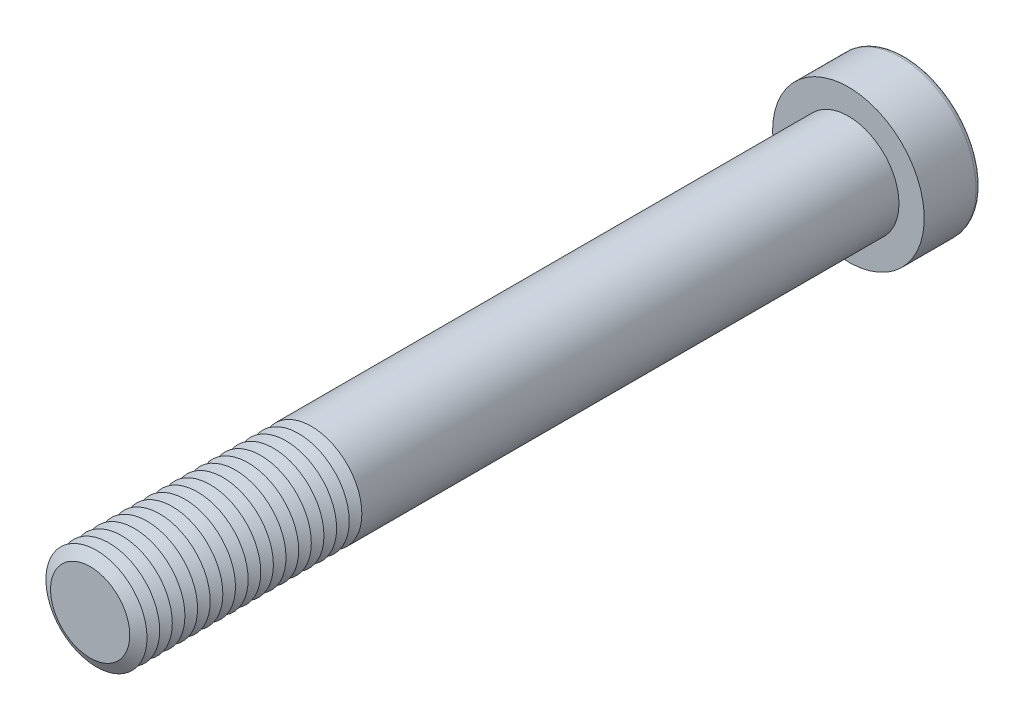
ISO-10303-21;
HEADER;
FILE_DESCRIPTION(('STEP AP214'),'2;1');
FILE_NAME('part.step','',(''),(''),'','','');
FILE_SCHEMA(('AUTOMOTIVE_DESIGN { 1 0 10303 214 1 1 1 1 }'));
ENDSEC;
DATA;
#1=APPLICATION_CONTEXT('core data for automotive mechanical design processes');
#2=APPLICATION_PROTOCOL_DEFINITION('international standard','automotive_design',2000,#1);
#3=PRODUCT_CONTEXT('',#1,'mechanical');
#4=PRODUCT('Part','Part','',(#3));
#5=PRODUCT_RELATED_PRODUCT_CATEGORY('part','',(#4));
#6=PRODUCT_DEFINITION_FORMATION('','',#4);
#7=PRODUCT_DEFINITION_CONTEXT('part definition',#1,'design');
#8=PRODUCT_DEFINITION('design','',#6,#7);
#9=PRODUCT_DEFINITION_SHAPE('','',#8);
#10=(LENGTH_UNIT() NAMED_UNIT(*) SI_UNIT(.MILLI.,.METRE.));
#11=(NAMED_UNIT(*) PLANE_ANGLE_UNIT() SI_UNIT($,.RADIAN.));
#12=(NAMED_UNIT(*) SI_UNIT($,.STERADIAN.) SOLID_ANGLE_UNIT());
#13=UNCERTAINTY_MEASURE_WITH_UNIT(LENGTH_MEASURE(1.E-05),#10,'distance_accuracy_value','');
#14=(GEOMETRIC_REPRESENTATION_CONTEXT(3) GLOBAL_UNCERTAINTY_ASSIGNED_CONTEXT((#13)) GLOBAL_UNIT_ASSIGNED_CONTEXT((#10,
#11,#12)) REPRESENTATION_CONTEXT('',''));
#15=CARTESIAN_POINT('',(0.,0.,0.));
#16=DIRECTION('',(0.,0.,1.));
#17=DIRECTION('',(1.,0.,0.));
#18=AXIS2_PLACEMENT_3D('',#15,#16,#17);
#19=CARTESIAN_POINT('',(0.,0.,113.));
#20=DIRECTION('',(0.,0.,1.));
#21=DIRECTION('',(1.,0.,0.));
#22=AXIS2_PLACEMENT_3D('',#19,#20,#21);
#23=CONICAL_SURFACE('',#22,8.,1.0471975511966);
#24=CARTESIAN_POINT('',(0.,0.,112.));
#25=DIRECTION('',(0.,0.,1.));
#26=DIRECTION('',(1.,0.,0.));
#27=AXIS2_PLACEMENT_3D('',#24,#25,#26);
#28=CIRCLE('',#27,6.26794919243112);
#29=CARTESIAN_POINT('',(6.26794919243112,0.,112.));
#30=VERTEX_POINT('',#29);
#31=EDGE_CURVE('E313',#30,#30,#28,.T.);
#32=ORIENTED_EDGE('',*,*,#31,.T.);
#33=EDGE_LOOP('',(#32));
#34=FACE_BOUND('',#33,.T.);
#35=CARTESIAN_POINT('',(0.,0.,113.));
#36=DIRECTION('',(0.,0.,1.));
#37=DIRECTION('',(1.,0.,0.));
#38=AXIS2_PLACEMENT_3D('',#35,#36,#37);
#39=CIRCLE('',#38,8.);
#40=CARTESIAN_POINT('',(8.,0.,113.));
#41=VERTEX_POINT('',#40);
#42=EDGE_CURVE('E316',#41,#41,#39,.T.);
#43=ORIENTED_EDGE('',*,*,#42,.F.);
#44=EDGE_LOOP('',(#43));
#45=FACE_BOUND('',#44,.T.);
#46=ADVANCED_FACE('F39',(#34,#45),#23,.T.);
#47=CARTESIAN_POINT('',(0.,0.,112.));
#48=DIRECTION('',(0.,0.,-1.));
#49=DIRECTION('',(-1.,0.,0.));
#50=AXIS2_PLACEMENT_3D('',#47,#48,#49);
#51=CONICAL_SURFACE('',#50,6.26794919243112,1.0471975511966);
#52=CARTESIAN_POINT('',(0.,0.,111.));
#53=DIRECTION('',(0.,0.,1.));
#54=DIRECTION('',(1.,0.,0.));
#55=AXIS2_PLACEMENT_3D('',#52,#53,#54);
#56=CIRCLE('',#55,8.);
#57=CARTESIAN_POINT('',(8.,0.,111.));
#58=VERTEX_POINT('',#57);
#59=EDGE_CURVE('E324',#58,#58,#56,.T.);
#60=ORIENTED_EDGE('',*,*,#59,.T.);
#61=EDGE_LOOP('',(#60));
#62=FACE_BOUND('',#61,.T.);
#63=ORIENTED_EDGE('',*,*,#31,.F.);
#64=EDGE_LOOP('',(#63));
#65=FACE_BOUND('',#64,.T.);
#66=ADVANCED_FACE('F244',(#62,#65),#51,.T.);
#67=CARTESIAN_POINT('',(0.,0.,120.));
#68=DIRECTION('',(0.,0.,1.));
#69=DIRECTION('',(1.,0.,0.));
#70=AXIS2_PLACEMENT_3D('',#67,#68,#69);
#71=PLANE('',#70);
#72=CARTESIAN_POINT('',(0.,0.,120.));
#73=DIRECTION('',(0.,0.,1.));
#74=DIRECTION('',(1.,0.,0.));
#75=AXIS2_PLACEMENT_3D('',#72,#73,#74);
#76=CIRCLE('',#75,6.26794919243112);
#77=CARTESIAN_POINT('',(6.26794919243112,0.,120.));
#78=VERTEX_POINT('',#77);
#79=EDGE_CURVE('E174',#78,#78,#76,.T.);
#80=ORIENTED_EDGE('',*,*,#79,.T.);
#81=EDGE_LOOP('',(#80));
#82=FACE_BOUND('',#81,.T.);
#83=ADVANCED_FACE('F250',(#82),#71,.T.);
#84=CARTESIAN_POINT('',(0.,0.,120.));
#85=DIRECTION('',(0.,0.,-1.));
#86=DIRECTION('',(-1.,0.,0.));
#87=AXIS2_PLACEMENT_3D('',#84,#85,#86);
#88=CONICAL_SURFACE('',#87,6.26794919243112,1.0471975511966);
#89=CARTESIAN_POINT('',(0.,0.,119.));
#90=DIRECTION('',(0.,0.,1.));
#91=DIRECTION('',(1.,0.,0.));
#92=AXIS2_PLACEMENT_3D('',#89,#90,#91);
#93=CIRCLE('',#92,8.);
#94=CARTESIAN_POINT('',(8.,0.,119.));
#95=VERTEX_POINT('',#94);
#96=EDGE_CURVE('E290',#95,#95,#93,.T.);
#97=ORIENTED_EDGE('',*,*,#96,.T.);
#98=EDGE_LOOP('',(#97));
#99=FACE_BOUND('',#98,.T.);
#100=ORIENTED_EDGE('',*,*,#79,.F.);
#101=EDGE_LOOP('',(#100));
#102=FACE_BOUND('',#101,.T.);
#103=ADVANCED_FACE('F198',(#99,#102),#88,.T.);
#104=CARTESIAN_POINT('',(0.,0.,119.));
#105=DIRECTION('',(0.,0.,1.));
#106=DIRECTION('',(1.,0.,0.));
#107=AXIS2_PLACEMENT_3D('',#104,#105,#106);
#108=CONICAL_SURFACE('',#107,8.,1.0471975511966);
#109=CARTESIAN_POINT('',(0.,0.,118.));
#110=DIRECTION('',(0.,0.,1.));
#111=DIRECTION('',(1.,0.,0.));
#112=AXIS2_PLACEMENT_3D('',#109,#110,#111);
#113=CIRCLE('',#112,6.26794919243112);
#114=CARTESIAN_POINT('',(6.26794919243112,0.,118.));
#115=VERTEX_POINT('',#114);
#116=EDGE_CURVE('E287',#115,#115,#113,.T.);
#117=ORIENTED_EDGE('',*,*,#116,.T.);
#118=EDGE_LOOP('',(#117));
#119=FACE_BOUND('',#118,.T.);
#120=ORIENTED_EDGE('',*,*,#96,.F.);
#121=EDGE_LOOP('',(#120));
#122=FACE_BOUND('',#121,.T.);
#123=ADVANCED_FACE('F276',(#119,#122),#108,.T.);
#124=CARTESIAN_POINT('',(0.,0.,118.));
#125=DIRECTION('',(0.,0.,-1.));
#126=DIRECTION('',(-1.,0.,0.));
#127=AXIS2_PLACEMENT_3D('',#124,#125,#126);
#128=CONICAL_SURFACE('',#127,6.26794919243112,1.0471975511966);
#129=CARTESIAN_POINT('',(0.,0.,117.));
#130=DIRECTION('',(0.,0.,1.));
#131=DIRECTION('',(1.,0.,0.));
#132=AXIS2_PLACEMENT_3D('',#129,#130,#131);
#133=CIRCLE('',#132,8.);
#134=CARTESIAN_POINT('',(8.,0.,117.));
#135=VERTEX_POINT('',#134);
#136=EDGE_CURVE('E299',#135,#135,#133,.T.);
#137=ORIENTED_EDGE('',*,*,#136,.T.);
#138=EDGE_LOOP('',(#137));
#139=FACE_BOUND('',#138,.T.);
#140=ORIENTED_EDGE('',*,*,#116,.F.);
#141=EDGE_LOOP('',(#140));
#142=FACE_BOUND('',#141,.T.);
#143=ADVANCED_FACE('F273',(#139,#142),#128,.T.);
#144=CARTESIAN_POINT('',(0.,0.,117.));
#145=DIRECTION('',(0.,0.,1.));
#146=DIRECTION('',(1.,0.,0.));
#147=AXIS2_PLACEMENT_3D('',#144,#145,#146);
#148=CONICAL_SURFACE('',#147,8.,1.0471975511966);
#149=CARTESIAN_POINT('',(0.,0.,116.));
#150=DIRECTION('',(0.,0.,1.));
#151=DIRECTION('',(1.,0.,0.));
#152=AXIS2_PLACEMENT_3D('',#149,#150,#151);
#153=CIRCLE('',#152,6.26794919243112);
#154=CARTESIAN_POINT('',(6.26794919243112,0.,116.));
#155=VERTEX_POINT('',#154);
#156=EDGE_CURVE('E292',#155,#155,#153,.T.);
#157=ORIENTED_EDGE('',*,*,#156,.T.);
#158=EDGE_LOOP('',(#157));
#159=FACE_BOUND('',#158,.T.);
#160=ORIENTED_EDGE('',*,*,#136,.F.);
#161=EDGE_LOOP('',(#160));
#162=FACE_BOUND('',#161,.T.);
#163=ADVANCED_FACE('F269',(#159,#162),#148,.T.);
#164=CARTESIAN_POINT('',(0.,0.,116.));
#165=DIRECTION('',(0.,0.,-1.));
#166=DIRECTION('',(-1.,0.,0.));
#167=AXIS2_PLACEMENT_3D('',#164,#165,#166);
#168=CONICAL_SURFACE('',#167,6.26794919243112,1.0471975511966);
#169=CARTESIAN_POINT('',(0.,0.,115.));
#170=DIRECTION('',(0.,0.,1.));
#171=DIRECTION('',(1.,0.,0.));
#172=AXIS2_PLACEMENT_3D('',#169,#170,#171);
#173=CIRCLE('',#172,8.);
#174=CARTESIAN_POINT('',(8.,0.,115.));
#175=VERTEX_POINT('',#174);
#176=EDGE_CURVE('E309',#175,#175,#173,.T.);
#177=ORIENTED_EDGE('',*,*,#176,.T.);
#178=EDGE_LOOP('',(#177));
#179=FACE_BOUND('',#178,.T.);
#180=ORIENTED_EDGE('',*,*,#156,.F.);
#181=EDGE_LOOP('',(#180));
#182=FACE_BOUND('',#181,.T.);
#183=ADVANCED_FACE('F265',(#179,#182),#168,.T.);
#184=CARTESIAN_POINT('',(0.,0.,115.));
#185=DIRECTION('',(0.,0.,1.));
#186=DIRECTION('',(1.,0.,0.));
#187=AXIS2_PLACEMENT_3D('',#184,#185,#186);
#188=CONICAL_SURFACE('',#187,8.,1.0471975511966);
#189=CARTESIAN_POINT('',(0.,0.,114.));
#190=DIRECTION('',(0.,0.,1.));
#191=DIRECTION('',(1.,0.,0.));
#192=AXIS2_PLACEMENT_3D('',#189,#190,#191);
#193=CIRCLE('',#192,6.26794919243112);
#194=CARTESIAN_POINT('',(6.26794919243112,0.,114.));
#195=VERTEX_POINT('',#194);
#196=EDGE_CURVE('E305',#195,#195,#193,.T.);
#197=ORIENTED_EDGE('',*,*,#196,.T.);
#198=EDGE_LOOP('',(#197));
#199=FACE_BOUND('',#198,.T.);
#200=ORIENTED_EDGE('',*,*,#176,.F.);
#201=EDGE_LOOP('',(#200));
#202=FACE_BOUND('',#201,.T.);
#203=ADVANCED_FACE('F261',(#199,#202),#188,.T.);
#204=CARTESIAN_POINT('',(0.,0.,114.));
#205=DIRECTION('',(0.,0.,-1.));
#206=DIRECTION('',(-1.,0.,0.));
#207=AXIS2_PLACEMENT_3D('',#204,#205,#206);
#208=CONICAL_SURFACE('',#207,6.26794919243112,1.0471975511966);
#209=ORIENTED_EDGE('',*,*,#42,.T.);
#210=EDGE_LOOP('',(#209));
#211=FACE_BOUND('',#210,.T.);
#212=ORIENTED_EDGE('',*,*,#196,.F.);
#213=EDGE_LOOP('',(#212));
#214=FACE_BOUND('',#213,.T.);
#215=ADVANCED_FACE('F257',(#211,#214),#208,.T.);
#216=CARTESIAN_POINT('',(0.,0.,111.));
#217=DIRECTION('',(0.,0.,1.));
#218=DIRECTION('',(1.,0.,0.));
#219=AXIS2_PLACEMENT_3D('',#216,#217,#218);
#220=CONICAL_SURFACE('',#219,8.,1.0471975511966);
#221=CARTESIAN_POINT('',(0.,0.,110.));
#222=DIRECTION('',(0.,0.,1.));
#223=DIRECTION('',(1.,0.,0.));
#224=AXIS2_PLACEMENT_3D('',#221,#222,#223);
#225=CIRCLE('',#224,6.26794919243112);
#226=CARTESIAN_POINT('',(6.26794919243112,0.,110.));
#227=VERTEX_POINT('',#226);
#228=EDGE_CURVE('E320',#227,#227,#225,.T.);
#229=ORIENTED_EDGE('',*,*,#228,.T.);
#230=EDGE_LOOP('',(#229));
#231=FACE_BOUND('',#230,.T.);
#232=ORIENTED_EDGE('',*,*,#59,.F.);
#233=EDGE_LOOP('',(#232));
#234=FACE_BOUND('',#233,.T.);
#235=ADVANCED_FACE('F260',(#231,#234),#220,.T.);
#236=CARTESIAN_POINT('',(0.,0.,110.));
#237=DIRECTION('',(0.,0.,-1.));
#238=DIRECTION('',(-1.,0.,0.));
#239=AXIS2_PLACEMENT_3D('',#236,#237,#238);
#240=CONICAL_SURFACE('',#239,6.26794919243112,1.0471975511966);
#241=CARTESIAN_POINT('',(0.,0.,109.));
#242=DIRECTION('',(0.,0.,1.));
#243=DIRECTION('',(1.,0.,0.));
#244=AXIS2_PLACEMENT_3D('',#241,#242,#243);
#245=CIRCLE('',#244,8.);
#246=CARTESIAN_POINT('',(8.,0.,109.));
#247=VERTEX_POINT('',#246);
#248=EDGE_CURVE('E332',#247,#247,#245,.T.);
#249=ORIENTED_EDGE('',*,*,#248,.T.);
#250=EDGE_LOOP('',(#249));
#251=FACE_BOUND('',#250,.T.);
#252=ORIENTED_EDGE('',*,*,#228,.F.);
#253=EDGE_LOOP('',(#252));
#254=FACE_BOUND('',#253,.T.);
#255=ADVANCED_FACE('F527',(#251,#254),#240,.T.);
#256=CARTESIAN_POINT('',(0.,0.,109.));
#257=DIRECTION('',(0.,0.,1.));
#258=DIRECTION('',(1.,0.,0.));
#259=AXIS2_PLACEMENT_3D('',#256,#257,#258);
#260=CONICAL_SURFACE('',#259,8.,1.0471975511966);
#261=CARTESIAN_POINT('',(0.,0.,108.));
#262=DIRECTION('',(0.,0.,1.));
#263=DIRECTION('',(1.,0.,0.));
#264=AXIS2_PLACEMENT_3D('',#261,#262,#263);
#265=CIRCLE('',#264,6.26794919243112);
#266=CARTESIAN_POINT('',(6.26794919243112,0.,108.));
#267=VERTEX_POINT('',#266);
#268=EDGE_CURVE('E328',#267,#267,#265,.T.);
#269=ORIENTED_EDGE('',*,*,#268,.T.);
#270=EDGE_LOOP('',(#269));
#271=FACE_BOUND('',#270,.T.);
#272=ORIENTED_EDGE('',*,*,#248,.F.);
#273=EDGE_LOOP('',(#272));
#274=FACE_BOUND('',#273,.T.);
#275=ADVANCED_FACE('F523',(#271,#274),#260,.T.);
#276=CARTESIAN_POINT('',(0.,0.,108.));
#277=DIRECTION('',(0.,0.,-1.));
#278=DIRECTION('',(-1.,0.,0.));
#279=AXIS2_PLACEMENT_3D('',#276,#277,#278);
#280=CONICAL_SURFACE('',#279,6.26794919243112,1.0471975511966);
#281=CARTESIAN_POINT('',(0.,0.,107.));
#282=DIRECTION('',(0.,0.,1.));
#283=DIRECTION('',(1.,0.,0.));
#284=AXIS2_PLACEMENT_3D('',#281,#282,#283);
#285=CIRCLE('',#284,8.);
#286=CARTESIAN_POINT('',(8.,0.,107.));
#287=VERTEX_POINT('',#286);
#288=EDGE_CURVE('E340',#287,#287,#285,.T.);
#289=ORIENTED_EDGE('',*,*,#288,.T.);
#290=EDGE_LOOP('',(#289));
#291=FACE_BOUND('',#290,.T.);
#292=ORIENTED_EDGE('',*,*,#268,.F.);
#293=EDGE_LOOP('',(#292));
#294=FACE_BOUND('',#293,.T.);
#295=ADVANCED_FACE('F519',(#291,#294),#280,.T.);
#296=CARTESIAN_POINT('',(0.,0.,107.));
#297=DIRECTION('',(0.,0.,1.));
#298=DIRECTION('',(1.,0.,0.));
#299=AXIS2_PLACEMENT_3D('',#296,#297,#298);
#300=CONICAL_SURFACE('',#299,8.,1.0471975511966);
#301=CARTESIAN_POINT('',(0.,0.,106.));
#302=DIRECTION('',(0.,0.,1.));
#303=DIRECTION('',(1.,0.,0.));
#304=AXIS2_PLACEMENT_3D('',#301,#302,#303);
#305=CIRCLE('',#304,6.26794919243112);
#306=CARTESIAN_POINT('',(6.26794919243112,0.,106.));
#307=VERTEX_POINT('',#306);
#308=EDGE_CURVE('E336',#307,#307,#305,.T.);
#309=ORIENTED_EDGE('',*,*,#308,.T.);
#310=EDGE_LOOP('',(#309));
#311=FACE_BOUND('',#310,.T.);
#312=ORIENTED_EDGE('',*,*,#288,.F.);
#313=EDGE_LOOP('',(#312));
#314=FACE_BOUND('',#313,.T.);
#315=ADVANCED_FACE('F515',(#311,#314),#300,.T.);
#316=CARTESIAN_POINT('',(0.,0.,106.));
#317=DIRECTION('',(0.,0.,-1.));
#318=DIRECTION('',(-1.,0.,0.));
#319=AXIS2_PLACEMENT_3D('',#316,#317,#318);
#320=CONICAL_SURFACE('',#319,6.26794919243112,1.0471975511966);
#321=CARTESIAN_POINT('',(0.,0.,105.));
#322=DIRECTION('',(0.,0.,1.));
#323=DIRECTION('',(1.,0.,0.));
#324=AXIS2_PLACEMENT_3D('',#321,#322,#323);
#325=CIRCLE('',#324,8.);
#326=CARTESIAN_POINT('',(8.,0.,105.));
#327=VERTEX_POINT('',#326);
#328=EDGE_CURVE('E348',#327,#327,#325,.T.);
#329=ORIENTED_EDGE('',*,*,#328,.T.);
#330=EDGE_LOOP('',(#329));
#331=FACE_BOUND('',#330,.T.);
#332=ORIENTED_EDGE('',*,*,#308,.F.);
#333=EDGE_LOOP('',(#332));
#334=FACE_BOUND('',#333,.T.);
#335=ADVANCED_FACE('F511',(#331,#334),#320,.T.);
#336=CARTESIAN_POINT('',(0.,0.,105.));
#337=DIRECTION('',(0.,0.,1.));
#338=DIRECTION('',(1.,0.,0.));
#339=AXIS2_PLACEMENT_3D('',#336,#337,#338);
#340=CONICAL_SURFACE('',#339,8.,1.0471975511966);
#341=CARTESIAN_POINT('',(0.,0.,104.));
#342=DIRECTION('',(0.,0.,1.));
#343=DIRECTION('',(1.,0.,0.));
#344=AXIS2_PLACEMENT_3D('',#341,#342,#343);
#345=CIRCLE('',#344,6.26794919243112);
#346=CARTESIAN_POINT('',(6.26794919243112,0.,104.));
#347=VERTEX_POINT('',#346);
#348=EDGE_CURVE('E344',#347,#347,#345,.T.);
#349=ORIENTED_EDGE('',*,*,#348,.T.);
#350=EDGE_LOOP('',(#349));
#351=FACE_BOUND('',#350,.T.);
#352=ORIENTED_EDGE('',*,*,#328,.F.);
#353=EDGE_LOOP('',(#352));
#354=FACE_BOUND('',#353,.T.);
#355=ADVANCED_FACE('F507',(#351,#354),#340,.T.);
#356=CARTESIAN_POINT('',(0.,0.,104.));
#357=DIRECTION('',(0.,0.,-1.));
#358=DIRECTION('',(-1.,0.,0.));
#359=AXIS2_PLACEMENT_3D('',#356,#357,#358);
#360=CONICAL_SURFACE('',#359,6.26794919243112,1.0471975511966);
#361=CARTESIAN_POINT('',(0.,0.,103.));
#362=DIRECTION('',(0.,0.,1.));
#363=DIRECTION('',(1.,0.,0.));
#364=AXIS2_PLACEMENT_3D('',#361,#362,#363);
#365=CIRCLE('',#364,8.);
#366=CARTESIAN_POINT('',(8.,0.,103.));
#367=VERTEX_POINT('',#366);
#368=EDGE_CURVE('E355',#367,#367,#365,.T.);
#369=ORIENTED_EDGE('',*,*,#368,.T.);
#370=EDGE_LOOP('',(#369));
#371=FACE_BOUND('',#370,.T.);
#372=ORIENTED_EDGE('',*,*,#348,.F.);
#373=EDGE_LOOP('',(#372));
#374=FACE_BOUND('',#373,.T.);
#375=ADVANCED_FACE('F503',(#371,#374),#360,.T.);
#376=CARTESIAN_POINT('',(0.,0.,103.));
#377=DIRECTION('',(0.,0.,1.));
#378=DIRECTION('',(1.,0.,0.));
#379=AXIS2_PLACEMENT_3D('',#376,#377,#378);
#380=CONICAL_SURFACE('',#379,8.,1.0471975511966);
#381=CARTESIAN_POINT('',(0.,0.,102.));
#382=DIRECTION('',(0.,0.,1.));
#383=DIRECTION('',(1.,0.,0.));
#384=AXIS2_PLACEMENT_3D('',#381,#382,#383);
#385=CIRCLE('',#384,6.26794919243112);
#386=CARTESIAN_POINT('',(6.26794919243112,0.,102.));
#387=VERTEX_POINT('',#386);
#388=EDGE_CURVE('E352',#387,#387,#385,.T.);
#389=ORIENTED_EDGE('',*,*,#388,.T.);
#390=EDGE_LOOP('',(#389));
#391=FACE_BOUND('',#390,.T.);
#392=ORIENTED_EDGE('',*,*,#368,.F.);
#393=EDGE_LOOP('',(#392));
#394=FACE_BOUND('',#393,.T.);
#395=ADVANCED_FACE('F499',(#391,#394),#380,.T.);
#396=CARTESIAN_POINT('',(0.,0.,102.));
#397=DIRECTION('',(0.,0.,-1.));
#398=DIRECTION('',(-1.,0.,0.));
#399=AXIS2_PLACEMENT_3D('',#396,#397,#398);
#400=CONICAL_SURFACE('',#399,6.26794919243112,1.0471975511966);
#401=CARTESIAN_POINT('',(0.,0.,101.));
#402=DIRECTION('',(0.,0.,1.));
#403=DIRECTION('',(1.,0.,0.));
#404=AXIS2_PLACEMENT_3D('',#401,#402,#403);
#405=CIRCLE('',#404,8.);
#406=CARTESIAN_POINT('',(8.,0.,101.));
#407=VERTEX_POINT('',#406);
#408=EDGE_CURVE('E363',#407,#407,#405,.T.);
#409=ORIENTED_EDGE('',*,*,#408,.T.);
#410=EDGE_LOOP('',(#409));
#411=FACE_BOUND('',#410,.T.);
#412=ORIENTED_EDGE('',*,*,#388,.F.);
#413=EDGE_LOOP('',(#412));
#414=FACE_BOUND('',#413,.T.);
#415=ADVANCED_FACE('F495',(#411,#414),#400,.T.);
#416=CARTESIAN_POINT('',(0.,0.,101.));
#417=DIRECTION('',(0.,0.,1.));
#418=DIRECTION('',(1.,0.,0.));
#419=AXIS2_PLACEMENT_3D('',#416,#417,#418);
#420=CONICAL_SURFACE('',#419,8.,1.0471975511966);
#421=CARTESIAN_POINT('',(0.,0.,100.));
#422=DIRECTION('',(0.,0.,1.));
#423=DIRECTION('',(1.,0.,0.));
#424=AXIS2_PLACEMENT_3D('',#421,#422,#423);
#425=CIRCLE('',#424,6.26794919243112);
#426=CARTESIAN_POINT('',(6.26794919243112,0.,100.));
#427=VERTEX_POINT('',#426);
#428=EDGE_CURVE('E359',#427,#427,#425,.T.);
#429=ORIENTED_EDGE('',*,*,#428,.T.);
#430=EDGE_LOOP('',(#429));
#431=FACE_BOUND('',#430,.T.);
#432=ORIENTED_EDGE('',*,*,#408,.F.);
#433=EDGE_LOOP('',(#432));
#434=FACE_BOUND('',#433,.T.);
#435=ADVANCED_FACE('F491',(#431,#434),#420,.T.);
#436=CARTESIAN_POINT('',(0.,0.,100.));
#437=DIRECTION('',(0.,0.,-1.));
#438=DIRECTION('',(-1.,0.,0.));
#439=AXIS2_PLACEMENT_3D('',#436,#437,#438);
#440=CONICAL_SURFACE('',#439,6.26794919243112,1.0471975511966);
#441=CARTESIAN_POINT('',(0.,0.,99.));
#442=DIRECTION('',(0.,0.,1.));
#443=DIRECTION('',(1.,0.,0.));
#444=AXIS2_PLACEMENT_3D('',#441,#442,#443);
#445=CIRCLE('',#444,8.);
#446=CARTESIAN_POINT('',(8.,0.,99.));
#447=VERTEX_POINT('',#446);
#448=EDGE_CURVE('E371',#447,#447,#445,.T.);
#449=ORIENTED_EDGE('',*,*,#448,.T.);
#450=EDGE_LOOP('',(#449));
#451=FACE_BOUND('',#450,.T.);
#452=ORIENTED_EDGE('',*,*,#428,.F.);
#453=EDGE_LOOP('',(#452));
#454=FACE_BOUND('',#453,.T.);
#455=ADVANCED_FACE('F487',(#451,#454),#440,.T.);
#456=CARTESIAN_POINT('',(0.,0.,99.));
#457=DIRECTION('',(0.,0.,1.));
#458=DIRECTION('',(1.,0.,0.));
#459=AXIS2_PLACEMENT_3D('',#456,#457,#458);
#460=CONICAL_SURFACE('',#459,8.,1.0471975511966);
#461=CARTESIAN_POINT('',(0.,0.,98.));
#462=DIRECTION('',(0.,0.,1.));
#463=DIRECTION('',(1.,0.,0.));
#464=AXIS2_PLACEMENT_3D('',#461,#462,#463);
#465=CIRCLE('',#464,6.26794919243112);
#466=CARTESIAN_POINT('',(6.26794919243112,0.,98.));
#467=VERTEX_POINT('',#466);
#468=EDGE_CURVE('E367',#467,#467,#465,.T.);
#469=ORIENTED_EDGE('',*,*,#468,.T.);
#470=EDGE_LOOP('',(#469));
#471=FACE_BOUND('',#470,.T.);
#472=ORIENTED_EDGE('',*,*,#448,.F.);
#473=EDGE_LOOP('',(#472));
#474=FACE_BOUND('',#473,.T.);
#475=ADVANCED_FACE('F483',(#471,#474),#460,.T.);
#476=CARTESIAN_POINT('',(0.,0.,98.));
#477=DIRECTION('',(0.,0.,-1.));
#478=DIRECTION('',(-1.,0.,0.));
#479=AXIS2_PLACEMENT_3D('',#476,#477,#478);
#480=CONICAL_SURFACE('',#479,6.26794919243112,1.0471975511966);
#481=CARTESIAN_POINT('',(0.,0.,97.));
#482=DIRECTION('',(0.,0.,1.));
#483=DIRECTION('',(1.,0.,0.));
#484=AXIS2_PLACEMENT_3D('',#481,#482,#483);
#485=CIRCLE('',#484,8.);
#486=CARTESIAN_POINT('',(8.,0.,97.));
#487=VERTEX_POINT('',#486);
#488=EDGE_CURVE('E379',#487,#487,#485,.T.);
#489=ORIENTED_EDGE('',*,*,#488,.T.);
#490=EDGE_LOOP('',(#489));
#491=FACE_BOUND('',#490,.T.);
#492=ORIENTED_EDGE('',*,*,#468,.F.);
#493=EDGE_LOOP('',(#492));
#494=FACE_BOUND('',#493,.T.);
#495=ADVANCED_FACE('F479',(#491,#494),#480,.T.);
#496=CARTESIAN_POINT('',(0.,0.,97.));
#497=DIRECTION('',(0.,0.,1.));
#498=DIRECTION('',(1.,0.,0.));
#499=AXIS2_PLACEMENT_3D('',#496,#497,#498);
#500=CONICAL_SURFACE('',#499,8.,1.0471975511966);
#501=CARTESIAN_POINT('',(0.,0.,96.));
#502=DIRECTION('',(0.,0.,1.));
#503=DIRECTION('',(1.,0.,0.));
#504=AXIS2_PLACEMENT_3D('',#501,#502,#503);
#505=CIRCLE('',#504,6.26794919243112);
#506=CARTESIAN_POINT('',(6.26794919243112,0.,96.));
#507=VERTEX_POINT('',#506);
#508=EDGE_CURVE('E375',#507,#507,#505,.T.);
#509=ORIENTED_EDGE('',*,*,#508,.T.);
#510=EDGE_LOOP('',(#509));
#511=FACE_BOUND('',#510,.T.);
#512=ORIENTED_EDGE('',*,*,#488,.F.);
#513=EDGE_LOOP('',(#512));
#514=FACE_BOUND('',#513,.T.);
#515=ADVANCED_FACE('F475',(#511,#514),#500,.T.);
#516=CARTESIAN_POINT('',(0.,0.,96.));
#517=DIRECTION('',(0.,0.,-1.));
#518=DIRECTION('',(-1.,0.,0.));
#519=AXIS2_PLACEMENT_3D('',#516,#517,#518);
#520=CONICAL_SURFACE('',#519,6.26794919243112,1.0471975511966);
#521=CARTESIAN_POINT('',(0.,0.,95.));
#522=DIRECTION('',(0.,0.,1.));
#523=DIRECTION('',(1.,0.,0.));
#524=AXIS2_PLACEMENT_3D('',#521,#522,#523);
#525=CIRCLE('',#524,8.);
#526=CARTESIAN_POINT('',(8.,0.,95.));
#527=VERTEX_POINT('',#526);
#528=EDGE_CURVE('E387',#527,#527,#525,.T.);
#529=ORIENTED_EDGE('',*,*,#528,.T.);
#530=EDGE_LOOP('',(#529));
#531=FACE_BOUND('',#530,.T.);
#532=ORIENTED_EDGE('',*,*,#508,.F.);
#533=EDGE_LOOP('',(#532));
#534=FACE_BOUND('',#533,.T.);
#535=ADVANCED_FACE('F471',(#531,#534),#520,.T.);
#536=CARTESIAN_POINT('',(0.,0.,95.));
#537=DIRECTION('',(0.,0.,1.));
#538=DIRECTION('',(1.,0.,0.));
#539=AXIS2_PLACEMENT_3D('',#536,#537,#538);
#540=CONICAL_SURFACE('',#539,8.,1.0471975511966);
#541=CARTESIAN_POINT('',(0.,0.,94.));
#542=DIRECTION('',(0.,0.,1.));
#543=DIRECTION('',(1.,0.,0.));
#544=AXIS2_PLACEMENT_3D('',#541,#542,#543);
#545=CIRCLE('',#544,6.26794919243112);
#546=CARTESIAN_POINT('',(6.26794919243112,0.,94.));
#547=VERTEX_POINT('',#546);
#548=EDGE_CURVE('E383',#547,#547,#545,.T.);
#549=ORIENTED_EDGE('',*,*,#548,.T.);
#550=EDGE_LOOP('',(#549));
#551=FACE_BOUND('',#550,.T.);
#552=ORIENTED_EDGE('',*,*,#528,.F.);
#553=EDGE_LOOP('',(#552));
#554=FACE_BOUND('',#553,.T.);
#555=ADVANCED_FACE('F467',(#551,#554),#540,.T.);
#556=CARTESIAN_POINT('',(0.,0.,94.));
#557=DIRECTION('',(0.,0.,-1.));
#558=DIRECTION('',(-1.,0.,0.));
#559=AXIS2_PLACEMENT_3D('',#556,#557,#558);
#560=CONICAL_SURFACE('',#559,6.26794919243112,1.0471975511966);
#561=CARTESIAN_POINT('',(0.,0.,93.));
#562=DIRECTION('',(0.,0.,1.));
#563=DIRECTION('',(1.,0.,0.));
#564=AXIS2_PLACEMENT_3D('',#561,#562,#563);
#565=CIRCLE('',#564,8.);
#566=CARTESIAN_POINT('',(8.,0.,93.));
#567=VERTEX_POINT('',#566);
#568=EDGE_CURVE('E395',#567,#567,#565,.T.);
#569=ORIENTED_EDGE('',*,*,#568,.T.);
#570=EDGE_LOOP('',(#569));
#571=FACE_BOUND('',#570,.T.);
#572=ORIENTED_EDGE('',*,*,#548,.F.);
#573=EDGE_LOOP('',(#572));
#574=FACE_BOUND('',#573,.T.);
#575=ADVANCED_FACE('F463',(#571,#574),#560,.T.);
#576=CARTESIAN_POINT('',(0.,0.,93.));
#577=DIRECTION('',(0.,0.,1.));
#578=DIRECTION('',(1.,0.,0.));
#579=AXIS2_PLACEMENT_3D('',#576,#577,#578);
#580=CONICAL_SURFACE('',#579,8.,1.0471975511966);
#581=CARTESIAN_POINT('',(0.,0.,92.));
#582=DIRECTION('',(0.,0.,1.));
#583=DIRECTION('',(1.,0.,0.));
#584=AXIS2_PLACEMENT_3D('',#581,#582,#583);
#585=CIRCLE('',#584,6.26794919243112);
#586=CARTESIAN_POINT('',(6.26794919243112,0.,92.));
#587=VERTEX_POINT('',#586);
#588=EDGE_CURVE('E391',#587,#587,#585,.T.);
#589=ORIENTED_EDGE('',*,*,#588,.T.);
#590=EDGE_LOOP('',(#589));
#591=FACE_BOUND('',#590,.T.);
#592=ORIENTED_EDGE('',*,*,#568,.F.);
#593=EDGE_LOOP('',(#592));
#594=FACE_BOUND('',#593,.T.);
#595=ADVANCED_FACE('F459',(#591,#594),#580,.T.);
#596=CARTESIAN_POINT('',(0.,0.,92.));
#597=DIRECTION('',(0.,0.,-1.));
#598=DIRECTION('',(-1.,0.,0.));
#599=AXIS2_PLACEMENT_3D('',#596,#597,#598);
#600=CONICAL_SURFACE('',#599,6.26794919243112,1.0471975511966);
#601=CARTESIAN_POINT('',(0.,0.,91.));
#602=DIRECTION('',(0.,0.,1.));
#603=DIRECTION('',(1.,0.,0.));
#604=AXIS2_PLACEMENT_3D('',#601,#602,#603);
#605=CIRCLE('',#604,8.);
#606=CARTESIAN_POINT('',(8.,0.,91.));
#607=VERTEX_POINT('',#606);
#608=EDGE_CURVE('E403',#607,#607,#605,.T.);
#609=ORIENTED_EDGE('',*,*,#608,.T.);
#610=EDGE_LOOP('',(#609));
#611=FACE_BOUND('',#610,.T.);
#612=ORIENTED_EDGE('',*,*,#588,.F.);
#613=EDGE_LOOP('',(#612));
#614=FACE_BOUND('',#613,.T.);
#615=ADVANCED_FACE('F455',(#611,#614),#600,.T.);
#616=CARTESIAN_POINT('',(0.,0.,91.));
#617=DIRECTION('',(0.,0.,1.));
#618=DIRECTION('',(1.,0.,0.));
#619=AXIS2_PLACEMENT_3D('',#616,#617,#618);
#620=CONICAL_SURFACE('',#619,8.,1.0471975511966);
#621=CARTESIAN_POINT('',(0.,0.,90.));
#622=DIRECTION('',(0.,0.,1.));
#623=DIRECTION('',(1.,0.,0.));
#624=AXIS2_PLACEMENT_3D('',#621,#622,#623);
#625=CIRCLE('',#624,6.26794919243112);
#626=CARTESIAN_POINT('',(6.26794919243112,0.,90.));
#627=VERTEX_POINT('',#626);
#628=EDGE_CURVE('E399',#627,#627,#625,.T.);
#629=ORIENTED_EDGE('',*,*,#628,.T.);
#630=EDGE_LOOP('',(#629));
#631=FACE_BOUND('',#630,.T.);
#632=ORIENTED_EDGE('',*,*,#608,.F.);
#633=EDGE_LOOP('',(#632));
#634=FACE_BOUND('',#633,.T.);
#635=ADVANCED_FACE('F451',(#631,#634),#620,.T.);
#636=CARTESIAN_POINT('',(0.,0.,90.));
#637=DIRECTION('',(0.,0.,-1.));
#638=DIRECTION('',(-1.,0.,0.));
#639=AXIS2_PLACEMENT_3D('',#636,#637,#638);
#640=CONICAL_SURFACE('',#639,6.26794919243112,1.0471975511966);
#641=CARTESIAN_POINT('',(0.,0.,89.));
#642=DIRECTION('',(0.,0.,1.));
#643=DIRECTION('',(1.,0.,0.));
#644=AXIS2_PLACEMENT_3D('',#641,#642,#643);
#645=CIRCLE('',#644,8.);
#646=CARTESIAN_POINT('',(8.,0.,89.));
#647=VERTEX_POINT('',#646);
#648=EDGE_CURVE('E411',#647,#647,#645,.T.);
#649=ORIENTED_EDGE('',*,*,#648,.T.);
#650=EDGE_LOOP('',(#649));
#651=FACE_BOUND('',#650,.T.);
#652=ORIENTED_EDGE('',*,*,#628,.F.);
#653=EDGE_LOOP('',(#652));
#654=FACE_BOUND('',#653,.T.);
#655=ADVANCED_FACE('F447',(#651,#654),#640,.T.);
#656=CARTESIAN_POINT('',(0.,0.,89.));
#657=DIRECTION('',(0.,0.,1.));
#658=DIRECTION('',(1.,0.,0.));
#659=AXIS2_PLACEMENT_3D('',#656,#657,#658);
#660=CONICAL_SURFACE('',#659,8.,1.0471975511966);
#661=CARTESIAN_POINT('',(0.,0.,88.));
#662=DIRECTION('',(0.,0.,1.));
#663=DIRECTION('',(1.,0.,0.));
#664=AXIS2_PLACEMENT_3D('',#661,#662,#663);
#665=CIRCLE('',#664,6.26794919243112);
#666=CARTESIAN_POINT('',(6.26794919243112,0.,88.));
#667=VERTEX_POINT('',#666);
#668=EDGE_CURVE('E407',#667,#667,#665,.T.);
#669=ORIENTED_EDGE('',*,*,#668,.T.);
#670=EDGE_LOOP('',(#669));
#671=FACE_BOUND('',#670,.T.);
#672=ORIENTED_EDGE('',*,*,#648,.F.);
#673=EDGE_LOOP('',(#672));
#674=FACE_BOUND('',#673,.T.);
#675=ADVANCED_FACE('F442',(#671,#674),#660,.T.);
#676=CARTESIAN_POINT('',(0.,0.,88.));
#677=DIRECTION('',(0.,0.,-1.));
#678=DIRECTION('',(-1.,0.,0.));
#679=AXIS2_PLACEMENT_3D('',#676,#677,#678);
#680=CONICAL_SURFACE('',#679,6.26794919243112,1.0471975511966);
#681=CARTESIAN_POINT('',(0.,0.,87.));
#682=DIRECTION('',(0.,0.,1.));
#683=DIRECTION('',(1.,0.,0.));
#684=AXIS2_PLACEMENT_3D('',#681,#682,#683);
#685=CIRCLE('',#684,8.);
#686=CARTESIAN_POINT('',(8.,0.,87.));
#687=VERTEX_POINT('',#686);
#688=EDGE_CURVE('E422',#687,#687,#685,.T.);
#689=ORIENTED_EDGE('',*,*,#688,.T.);
#690=EDGE_LOOP('',(#689));
#691=FACE_BOUND('',#690,.T.);
#692=ORIENTED_EDGE('',*,*,#668,.F.);
#693=EDGE_LOOP('',(#692));
#694=FACE_BOUND('',#693,.T.);
#695=ADVANCED_FACE('F428',(#691,#694),#680,.T.);
#696=CARTESIAN_POINT('',(0.,0.,87.));
#697=DIRECTION('',(0.,0.,1.));
#698=DIRECTION('',(1.,0.,0.));
#699=AXIS2_PLACEMENT_3D('',#696,#697,#698);
#700=CONICAL_SURFACE('',#699,8.,1.0471975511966);
#701=CARTESIAN_POINT('',(0.,0.,86.));
#702=DIRECTION('',(0.,0.,1.));
#703=DIRECTION('',(1.,0.,0.));
#704=AXIS2_PLACEMENT_3D('',#701,#702,#703);
#705=CIRCLE('',#704,6.26794919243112);
#706=CARTESIAN_POINT('',(6.26794919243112,0.,86.));
#707=VERTEX_POINT('',#706);
#708=EDGE_CURVE('E415',#707,#707,#705,.T.);
#709=ORIENTED_EDGE('',*,*,#708,.T.);
#710=EDGE_LOOP('',(#709));
#711=FACE_BOUND('',#710,.T.);
#712=ORIENTED_EDGE('',*,*,#688,.F.);
#713=EDGE_LOOP('',(#712));
#714=FACE_BOUND('',#713,.T.);
#715=ADVANCED_FACE('F431',(#711,#714),#700,.T.);
#716=CARTESIAN_POINT('',(0.,0.,86.));
#717=DIRECTION('',(0.,0.,-1.));
#718=DIRECTION('',(-1.,0.,0.));
#719=AXIS2_PLACEMENT_3D('',#716,#717,#718);
#720=CONICAL_SURFACE('',#719,6.26794919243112,1.0471975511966);
#721=CARTESIAN_POINT('',(0.,0.,85.));
#722=DIRECTION('',(0.,0.,1.));
#723=DIRECTION('',(1.,0.,0.));
#724=AXIS2_PLACEMENT_3D('',#721,#722,#723);
#725=CIRCLE('',#724,8.);
#726=CARTESIAN_POINT('',(8.,0.,85.));
#727=VERTEX_POINT('',#726);
#728=EDGE_CURVE('E419',#727,#727,#725,.T.);
#729=ORIENTED_EDGE('',*,*,#728,.T.);
#730=EDGE_LOOP('',(#729));
#731=FACE_BOUND('',#730,.T.);
#732=ORIENTED_EDGE('',*,*,#708,.F.);
#733=EDGE_LOOP('',(#732));
#734=FACE_BOUND('',#733,.T.);
#735=ADVANCED_FACE('F433',(#731,#734),#720,.T.);
#736=CARTESIAN_POINT('',(0.,0.,0.));
#737=DIRECTION('',(0.,0.,-1.));
#738=DIRECTION('',(-1.,0.,0.));
#739=AXIS2_PLACEMENT_3D('',#736,#737,#738);
#740=CONICAL_SURFACE('',#739,6.,1.0471975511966);
#741=CARTESIAN_POINT('',(0.,0.,3.46410161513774));
#742=VERTEX_POINT('',#741);
#743=VERTEX_LOOP('',#742);
#744=FACE_BOUND('',#743,.T.);
#745=CARTESIAN_POINT('',(0.,0.,0.));
#746=DIRECTION('',(0.,0.,-1.));
#747=DIRECTION('',(-1.,0.,0.));
#748=AXIS2_PLACEMENT_3D('',#745,#746,#747);
#749=CIRCLE('',#748,6.);
#750=CARTESIAN_POINT('',(-5.19615242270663,3.,0.));
#751=VERTEX_POINT('',#750);
#752=CARTESIAN_POINT('',(0.,6.,0.));
#753=VERTEX_POINT('',#752);
#754=EDGE_CURVE('E149',#751,#753,#749,.T.);
#755=ORIENTED_EDGE('',*,*,#754,.T.);
#756=CARTESIAN_POINT('',(0.,0.,0.));
#757=DIRECTION('',(0.,0.,-1.));
#758=DIRECTION('',(-1.,0.,0.));
#759=AXIS2_PLACEMENT_3D('',#756,#757,#758);
#760=CIRCLE('',#759,6.);
#761=CARTESIAN_POINT('',(5.19615242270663,3.,0.));
#762=VERTEX_POINT('',#761);
#763=EDGE_CURVE('E54',#753,#762,#760,.T.);
#764=ORIENTED_EDGE('',*,*,#763,.T.);
#765=CARTESIAN_POINT('',(5.19615242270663,-3.,0.));
#766=VERTEX_POINT('',#765);
#767=EDGE_CURVE('E1058',#762,#766,#760,.T.);
#768=ORIENTED_EDGE('',*,*,#767,.T.);
#769=CARTESIAN_POINT('',(0.,-6.,0.));
#770=VERTEX_POINT('',#769);
#771=EDGE_CURVE('E1056',#766,#770,#760,.T.);
#772=ORIENTED_EDGE('',*,*,#771,.T.);
#773=CARTESIAN_POINT('',(-5.19615242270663,-3.,0.));
#774=VERTEX_POINT('',#773);
#775=EDGE_CURVE('E1050',#770,#774,#760,.T.);
#776=ORIENTED_EDGE('',*,*,#775,.T.);
#777=EDGE_CURVE('E1048',#774,#751,#760,.T.);
#778=ORIENTED_EDGE('',*,*,#777,.T.);
#779=EDGE_LOOP('',(#755,#764,#768,#772,#776,#778));
#780=FACE_BOUND('',#779,.T.);
#781=ADVANCED_FACE('F200',(#744,#780),#740,.F.);
#782=CARTESIAN_POINT('',(0.,0.,0.));
#783=DIRECTION('',(0.,0.,-1.));
#784=DIRECTION('',(-1.,0.,0.));
#785=AXIS2_PLACEMENT_3D('',#782,#783,#784);
#786=PLANE('',#785);
#787=ORIENTED_EDGE('',*,*,#763,.F.);
#788=DIRECTION('',(1.,0.,0.));
#789=VECTOR('',#788,1.);
#790=CARTESIAN_POINT('',(-3.46410161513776,6.,0.));
#791=LINE('',#790,#789);
#792=CARTESIAN_POINT('',(3.46410161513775,6.,0.));
#793=VERTEX_POINT('',#792);
#794=EDGE_CURVE('E1094',#753,#793,#791,.T.);
#795=ORIENTED_EDGE('',*,*,#794,.T.);
#796=DIRECTION('',(0.5,-0.866025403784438,0.));
#797=VECTOR('',#796,1.);
#798=CARTESIAN_POINT('',(3.46410161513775,6.,0.));
#799=LINE('',#798,#797);
#800=EDGE_CURVE('E155',#793,#762,#799,.T.);
#801=ORIENTED_EDGE('',*,*,#800,.T.);
#802=EDGE_LOOP('',(#787,#795,#801));
#803=FACE_BOUND('',#802,.T.);
#804=ADVANCED_FACE('F628',(#803),#786,.T.);
#805=ORIENTED_EDGE('',*,*,#767,.F.);
#806=CARTESIAN_POINT('',(6.92820323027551,0.,0.));
#807=VERTEX_POINT('',#806);
#808=EDGE_CURVE('E1097',#762,#807,#799,.T.);
#809=ORIENTED_EDGE('',*,*,#808,.T.);
#810=DIRECTION('',(-0.5,-0.866025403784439,0.));
#811=VECTOR('',#810,1.);
#812=CARTESIAN_POINT('',(6.92820323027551,0.,0.));
#813=LINE('',#812,#811);
#814=EDGE_CURVE('E1071',#807,#766,#813,.T.);
#815=ORIENTED_EDGE('',*,*,#814,.T.);
#816=EDGE_LOOP('',(#805,#809,#815));
#817=FACE_BOUND('',#816,.T.);
#818=ADVANCED_FACE('F638',(#817),#786,.T.);
#819=ORIENTED_EDGE('',*,*,#771,.F.);
#820=CARTESIAN_POINT('',(3.46410161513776,-6.,0.));
#821=VERTEX_POINT('',#820);
#822=EDGE_CURVE('E1073',#766,#821,#813,.T.);
#823=ORIENTED_EDGE('',*,*,#822,.T.);
#824=DIRECTION('',(-1.,0.,0.));
#825=VECTOR('',#824,1.);
#826=CARTESIAN_POINT('',(3.46410161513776,-6.,0.));
#827=LINE('',#826,#825);
#828=EDGE_CURVE('E1022',#821,#770,#827,.T.);
#829=ORIENTED_EDGE('',*,*,#828,.T.);
#830=EDGE_LOOP('',(#819,#823,#829));
#831=FACE_BOUND('',#830,.T.);
#832=ADVANCED_FACE('F648',(#831),#786,.T.);
#833=ORIENTED_EDGE('',*,*,#775,.F.);
#834=CARTESIAN_POINT('',(-3.46410161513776,-6.,0.));
#835=VERTEX_POINT('',#834);
#836=EDGE_CURVE('E1067',#770,#835,#827,.T.);
#837=ORIENTED_EDGE('',*,*,#836,.T.);
#838=DIRECTION('',(-0.5,0.866025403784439,0.));
#839=VECTOR('',#838,1.);
#840=CARTESIAN_POINT('',(-3.46410161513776,-6.,0.));
#841=LINE('',#840,#839);
#842=EDGE_CURVE('E1069',#835,#774,#841,.T.);
#843=ORIENTED_EDGE('',*,*,#842,.T.);
#844=EDGE_LOOP('',(#833,#837,#843));
#845=FACE_BOUND('',#844,.T.);
#846=ADVANCED_FACE('F656',(#845),#786,.T.);
#847=ORIENTED_EDGE('',*,*,#777,.F.);
#848=CARTESIAN_POINT('',(-6.92820323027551,0.,0.));
#849=VERTEX_POINT('',#848);
#850=EDGE_CURVE('E1075',#774,#849,#841,.T.);
#851=ORIENTED_EDGE('',*,*,#850,.T.);
#852=DIRECTION('',(0.5,0.866025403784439,0.));
#853=VECTOR('',#852,1.);
#854=CARTESIAN_POINT('',(-6.92820323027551,0.,0.));
#855=LINE('',#854,#853);
#856=EDGE_CURVE('E158',#849,#751,#855,.T.);
#857=ORIENTED_EDGE('',*,*,#856,.T.);
#858=EDGE_LOOP('',(#847,#851,#857));
#859=FACE_BOUND('',#858,.T.);
#860=ADVANCED_FACE('F230',(#859),#786,.T.);
#861=ORIENTED_EDGE('',*,*,#754,.F.);
#862=CARTESIAN_POINT('',(-3.46410161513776,6.,0.));
#863=VERTEX_POINT('',#862);
#864=EDGE_CURVE('E1081',#751,#863,#855,.T.);
#865=ORIENTED_EDGE('',*,*,#864,.T.);
#866=EDGE_CURVE('E1092',#863,#753,#791,.T.);
#867=ORIENTED_EDGE('',*,*,#866,.T.);
#868=EDGE_LOOP('',(#861,#865,#867));
#869=FACE_BOUND('',#868,.T.);
#870=ADVANCED_FACE('F640',(#869),#786,.T.);
#871=CARTESIAN_POINT('',(-3.46410161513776,6.,0.));
#872=DIRECTION('',(0.,1.,0.));
#873=DIRECTION('',(0.,0.,1.));
#874=AXIS2_PLACEMENT_3D('',#871,#872,#873);
#875=PLANE('',#874);
#876=DIRECTION('',(0.,0.,-1.));
#877=VECTOR('',#876,1.);
#878=CARTESIAN_POINT('',(-3.46410161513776,6.,0.));
#879=LINE('',#878,#877);
#880=CARTESIAN_POINT('',(-3.46410161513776,6.,-9.));
#881=VERTEX_POINT('',#880);
#882=EDGE_CURVE('E147',#863,#881,#879,.T.);
#883=ORIENTED_EDGE('',*,*,#882,.T.);
#884=CARTESIAN_POINT('',(-9.04322275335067,6.,-10.0515506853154));
#885=CARTESIAN_POINT('',(-8.77229389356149,6.,-9.99107568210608));
#886=CARTESIAN_POINT('',(-8.50119215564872,6.,-9.93136093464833));
#887=CARTESIAN_POINT('',(-7.95855825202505,6.,-9.81386229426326));
#888=CARTESIAN_POINT('',(-7.68702606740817,6.,-9.75607848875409));
#889=CARTESIAN_POINT('',(-7.14318995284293,6.,-9.64279905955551));
#890=CARTESIAN_POINT('',(-6.87088551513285,6.,-9.58730586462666));
#891=CARTESIAN_POINT('',(-6.32570082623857,6.,-9.47922577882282));
#892=CARTESIAN_POINT('',(-6.05282058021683,6.,-9.42663886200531));
#893=CARTESIAN_POINT('',(-5.50875458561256,6.,-9.32550177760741));
#894=CARTESIAN_POINT('',(-5.23757463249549,6.,-9.27692059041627));
#895=CARTESIAN_POINT('',(-4.69446863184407,6.,-9.18413302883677));
#896=CARTESIAN_POINT('',(-4.42254260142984,6.,-9.13992655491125));
#897=CARTESIAN_POINT('',(-3.87790333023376,6.,-9.05690830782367));
#898=CARTESIAN_POINT('',(-3.6051902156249,6.,-9.0180957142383));
#899=CARTESIAN_POINT('',(-3.05890080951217,6.,-8.94703062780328));
#900=CARTESIAN_POINT('',(-2.7853245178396,6.,-8.91477813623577));
#901=CARTESIAN_POINT('',(-2.23425545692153,6.,-8.85776959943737));
#902=CARTESIAN_POINT('',(-1.95675335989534,6.,-8.83310236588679));
#903=CARTESIAN_POINT('',(-1.40107824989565,6.,-8.79298360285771));
#904=CARTESIAN_POINT('',(-1.12290525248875,6.,-8.77753186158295));
#905=CARTESIAN_POINT('',(-0.566293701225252,6.,-8.75674610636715));
#906=CARTESIAN_POINT('',(-0.28785531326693,6.,-8.75140773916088));
#907=CARTESIAN_POINT('',(0.269026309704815,6.,-8.75117360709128));
#908=CARTESIAN_POINT('',(0.547469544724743,6.,-8.75627785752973));
#909=CARTESIAN_POINT('',(1.10511819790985,6.,-8.77664719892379));
#910=CARTESIAN_POINT('',(1.38432206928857,6.,-8.79195380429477));
#911=CARTESIAN_POINT('',(1.94205759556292,6.,-8.83187108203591));
#912=CARTESIAN_POINT('',(2.22058923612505,6.,-8.85648195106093));
#913=CARTESIAN_POINT('',(2.77698779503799,6.,-8.91379497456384));
#914=CARTESIAN_POINT('',(3.0548541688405,6.,-8.94650233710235));
#915=CARTESIAN_POINT('',(3.60969614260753,6.,-9.01868375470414));
#916=CARTESIAN_POINT('',(3.8866717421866,6.,-9.0581578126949));
#917=CARTESIAN_POINT('',(4.44700464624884,6.,-9.14374886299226));
#918=CARTESIAN_POINT('',(4.73033933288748,6.,-9.190012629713));
#919=CARTESIAN_POINT('',(5.29620685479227,6.,-9.28723184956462));
#920=CARTESIAN_POINT('',(5.57873966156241,6.,-9.3381874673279));
#921=CARTESIAN_POINT('',(6.14313105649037,6.,-9.44386031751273));
#922=CARTESIAN_POINT('',(6.42498956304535,6.,-9.49857798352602));
#923=CARTESIAN_POINT('',(6.98810511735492,6.,-9.61103289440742));
#924=CARTESIAN_POINT('',(7.26936215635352,6.,-9.66877018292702));
#925=CARTESIAN_POINT('',(8.11254995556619,6.,-9.84563705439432));
#926=CARTESIAN_POINT('',(8.67372006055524,6.,-9.96838761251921));
#927=CARTESIAN_POINT('',(9.79457370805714,6.,-10.2202420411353));
#928=CARTESIAN_POINT('',(10.3542573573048,6.,-10.3493454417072));
#929=CARTESIAN_POINT('',(11.4657945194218,6.,-10.6103395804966));
#930=CARTESIAN_POINT('',(12.0176605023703,6.,-10.7421773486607));
#931=CARTESIAN_POINT('',(13.1206665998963,6.,-11.0089002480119));
#932=CARTESIAN_POINT('',(13.6718066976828,6.,-11.1437854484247));
#933=CARTESIAN_POINT('',(14.7727697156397,6.,-11.4155878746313));
#934=CARTESIAN_POINT('',(15.3225934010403,6.,-11.5525020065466));
#935=CARTESIAN_POINT('',(16.4217957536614,6.,-11.8280226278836));
#936=CARTESIAN_POINT('',(16.971174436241,6.,-11.9666290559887));
#937=CARTESIAN_POINT('',(17.5204019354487,6.,-12.1058251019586));
#938=B_SPLINE_CURVE_WITH_KNOTS('',3,(#884,#885,#886,#887,#888,#889,#890,#891,#892,#893,#894,
#895,#896,#897,#898,#899,#900,#901,#902,#903,#904,#905,#906,#907,#908,#909,#910,#911,#912,#913,
#914,#915,#916,#917,#918,#919,#920,#921,#922,#923,#924,#925,#926,#927,#928,#929,#930,#931,#932,
#933,#934,#935,#936,#937),.UNSPECIFIED.,.F.,.F.,(4,2,2,2,2,2,2,2,2,2,2,2,2,2,2,2,2,2,2,2,2,2,2,
2,2,2,4),(0.,0.832792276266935,1.6656222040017,2.49931362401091,3.33299760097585,
4.15946050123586,4.98590459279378,5.81222284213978,6.63854125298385,7.47419540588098,
8.30983035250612,9.14510552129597,9.98038191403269,10.8190780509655,11.6577919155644,
12.4970466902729,13.336301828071,14.1975135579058,15.0587555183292,15.9200969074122,
16.7814507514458,18.5047000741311,20.2278221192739,21.929995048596,23.6322066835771,
25.3320460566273,27.0318240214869),.UNSPECIFIED.);
#939=CARTESIAN_POINT('',(3.46410161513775,6.,-9.));
#940=VERTEX_POINT('',#939);
#941=EDGE_CURVE('E124',#881,#940,#938,.T.);
#942=ORIENTED_EDGE('',*,*,#941,.T.);
#943=DIRECTION('',(0.,0.,-1.));
#944=VECTOR('',#943,1.);
#945=CARTESIAN_POINT('',(3.46410161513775,6.,0.));
#946=LINE('',#945,#944);
#947=EDGE_CURVE('E143',#793,#940,#946,.T.);
#948=ORIENTED_EDGE('',*,*,#947,.F.);
#949=ORIENTED_EDGE('',*,*,#794,.F.);
#950=ORIENTED_EDGE('',*,*,#866,.F.);
#951=EDGE_LOOP('',(#883,#942,#948,#949,#950));
#952=FACE_BOUND('',#951,.T.);
#953=ADVANCED_FACE('F141',(#952),#875,.F.);
#954=CARTESIAN_POINT('',(3.46410161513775,6.,0.));
#955=DIRECTION('',(0.866025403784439,0.5,0.));
#956=DIRECTION('',(-0.5,0.866025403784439,0.));
#957=AXIS2_PLACEMENT_3D('',#954,#955,#956);
#958=PLANE('',#957);
#959=ORIENTED_EDGE('',*,*,#947,.T.);
#960=CARTESIAN_POINT('',(3.46398614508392,6.0002,-9.00003094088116));
#961=CARTESIAN_POINT('',(3.60785114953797,5.75101850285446,-8.96146591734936));
#962=CARTESIAN_POINT('',(3.75197700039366,5.5013852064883,-8.92645521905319));
#963=CARTESIAN_POINT('',(4.0407377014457,5.00123700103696,-8.86494467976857));
#964=CARTESIAN_POINT('',(4.18537273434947,4.75072177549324,-8.83844829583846));
#965=CARTESIAN_POINT('',(4.47427486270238,4.25032861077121,-8.79551324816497));
#966=CARTESIAN_POINT('',(4.61854000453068,4.00045405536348,-8.77902338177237));
#967=CARTESIAN_POINT('',(4.90725426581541,3.5003862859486,-8.75691215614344));
#968=CARTESIAN_POINT('',(5.05170334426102,3.2501931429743,-8.75128869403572));
#969=CARTESIAN_POINT('',(5.34060150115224,2.7498068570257,-8.75128869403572));
#970=CARTESIAN_POINT('',(5.48505057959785,2.49961371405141,-8.75691215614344));
#971=CARTESIAN_POINT('',(5.77376484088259,1.99954594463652,-8.77902338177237));
#972=CARTESIAN_POINT('',(5.91802998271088,1.74967138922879,-8.79551324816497));
#973=CARTESIAN_POINT('',(6.20693211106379,1.24927822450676,-8.83844829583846));
#974=CARTESIAN_POINT('',(6.35156714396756,0.998762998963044,-8.86494467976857));
#975=CARTESIAN_POINT('',(6.6403278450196,0.498614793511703,-8.92645521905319));
#976=CARTESIAN_POINT('',(6.78445369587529,0.248981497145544,-8.96146591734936));
#977=CARTESIAN_POINT('',(6.92831870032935,-0.000199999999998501,-9.00003094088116));
#978=B_SPLINE_CURVE_WITH_KNOTS('',3,(#960,#961,#962,#963,#964,#965,#966,#967,#968,#969,#970,
#971,#972,#973,#974,#975,#976,#977),.UNSPECIFIED.,.F.,.F.,(4,2,2,2,2,2,2,2,4),(0.,
0.870954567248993,1.74226232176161,2.60907321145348,3.47571633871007,4.34235946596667,
5.20917035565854,6.08047811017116,6.95143267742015),.UNSPECIFIED.);
#979=CARTESIAN_POINT('',(6.92820323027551,0.,-9.));
#980=VERTEX_POINT('',#979);
#981=EDGE_CURVE('E11',#940,#980,#978,.T.);
#982=ORIENTED_EDGE('',*,*,#981,.T.);
#983=DIRECTION('',(0.,0.,-1.));
#984=VECTOR('',#983,1.);
#985=CARTESIAN_POINT('',(6.92820323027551,0.,0.));
#986=LINE('',#985,#984);
#987=EDGE_CURVE('E157',#807,#980,#986,.T.);
#988=ORIENTED_EDGE('',*,*,#987,.F.);
#989=ORIENTED_EDGE('',*,*,#808,.F.);
#990=ORIENTED_EDGE('',*,*,#800,.F.);
#991=EDGE_LOOP('',(#959,#982,#988,#989,#990));
#992=FACE_BOUND('',#991,.T.);
#993=ADVANCED_FACE('F152',(#992),#958,.F.);
#994=CARTESIAN_POINT('',(6.92820323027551,0.,0.));
#995=DIRECTION('',(0.866025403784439,-0.5,0.));
#996=DIRECTION('',(0.5,0.866025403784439,0.));
#997=AXIS2_PLACEMENT_3D('',#994,#995,#996);
#998=PLANE('',#997);
#999=ORIENTED_EDGE('',*,*,#987,.T.);
#1000=CARTESIAN_POINT('',(6.92831870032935,0.000200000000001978,-9.00003094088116));
#1001=CARTESIAN_POINT('',(6.78445369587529,-0.24898149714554,-8.96146591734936));
#1002=CARTESIAN_POINT('',(6.6403278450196,-0.498614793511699,-8.92645521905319));
#1003=CARTESIAN_POINT('',(6.35156714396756,-0.99876299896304,-8.86494467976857));
#1004=CARTESIAN_POINT('',(6.20693211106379,-1.24927822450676,-8.83844829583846));
#1005=CARTESIAN_POINT('',(5.91802998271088,-1.74967138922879,-8.79551324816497));
#1006=CARTESIAN_POINT('',(5.77376484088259,-1.99954594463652,-8.77902338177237));
#1007=CARTESIAN_POINT('',(5.48505057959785,-2.4996137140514,-8.75691215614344));
#1008=CARTESIAN_POINT('',(5.34060150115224,-2.7498068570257,-8.75128869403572));
#1009=CARTESIAN_POINT('',(5.05170334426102,-3.2501931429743,-8.75128869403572));
#1010=CARTESIAN_POINT('',(4.90725426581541,-3.50038628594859,-8.75691215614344));
#1011=CARTESIAN_POINT('',(4.61854000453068,-4.00045405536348,-8.77902338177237));
#1012=CARTESIAN_POINT('',(4.47427486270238,-4.25032861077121,-8.79551324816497));
#1013=CARTESIAN_POINT('',(4.18537273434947,-4.75072177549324,-8.83844829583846));
#1014=CARTESIAN_POINT('',(4.04073770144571,-5.00123700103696,-8.86494467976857));
#1015=CARTESIAN_POINT('',(3.75197700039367,-5.5013852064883,-8.92645521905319));
#1016=CARTESIAN_POINT('',(3.60785114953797,-5.75101850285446,-8.96146591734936));
#1017=CARTESIAN_POINT('',(3.46398614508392,-6.0002,-9.00003094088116));
#1018=B_SPLINE_CURVE_WITH_KNOTS('',3,(#1000,#1001,#1002,#1003,#1004,#1005,#1006,#1007,#1008,
#1009,#1010,#1011,#1012,#1013,#1014,#1015,#1016,#1017),.UNSPECIFIED.,.F.,.F.,(4,2,2,2,2,2,2,2,
4),(0.,0.870954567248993,1.74226232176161,2.60907321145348,3.47571633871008,4.34235946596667,
5.20917035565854,6.08047811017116,6.95143267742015),.UNSPECIFIED.);
#1019=CARTESIAN_POINT('',(3.46410161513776,-6.,-9.));
#1020=VERTEX_POINT('',#1019);
#1021=EDGE_CURVE('E173',#980,#1020,#1018,.T.);
#1022=ORIENTED_EDGE('',*,*,#1021,.T.);
#1023=DIRECTION('',(0.,0.,-1.));
#1024=VECTOR('',#1023,1.);
#1025=CARTESIAN_POINT('',(3.46410161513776,-6.,0.));
#1026=LINE('',#1025,#1024);
#1027=EDGE_CURVE('E1017',#821,#1020,#1026,.T.);
#1028=ORIENTED_EDGE('',*,*,#1027,.F.);
#1029=ORIENTED_EDGE('',*,*,#822,.F.);
#1030=ORIENTED_EDGE('',*,*,#814,.F.);
#1031=EDGE_LOOP('',(#999,#1022,#1028,#1029,#1030));
#1032=FACE_BOUND('',#1031,.T.);
#1033=ADVANCED_FACE('F190',(#1032),#998,.F.);
#1034=CARTESIAN_POINT('',(3.46410161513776,-6.,0.));
#1035=DIRECTION('',(0.,-1.,0.));
#1036=DIRECTION('',(0.,0.,-1.));
#1037=AXIS2_PLACEMENT_3D('',#1034,#1035,#1036);
#1038=PLANE('',#1037);
#1039=ORIENTED_EDGE('',*,*,#1027,.T.);
#1040=CARTESIAN_POINT('',(-9.04322275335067,-6.,-10.0515506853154));
#1041=CARTESIAN_POINT('',(-8.77229389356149,-6.,-9.99107568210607));
#1042=CARTESIAN_POINT('',(-8.50119215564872,-6.,-9.93136093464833));
#1043=CARTESIAN_POINT('',(-7.95855825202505,-6.,-9.81386229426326));
#1044=CARTESIAN_POINT('',(-7.68702606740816,-6.,-9.75607848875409));
#1045=CARTESIAN_POINT('',(-7.14318995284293,-6.,-9.64279905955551));
#1046=CARTESIAN_POINT('',(-6.87088551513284,-6.,-9.58730586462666));
#1047=CARTESIAN_POINT('',(-6.32570082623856,-6.,-9.47922577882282));
#1048=CARTESIAN_POINT('',(-6.05282058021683,-6.,-9.42663886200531));
#1049=CARTESIAN_POINT('',(-5.50875458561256,-6.,-9.32550177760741));
#1050=CARTESIAN_POINT('',(-5.23757463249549,-6.,-9.27692059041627));
#1051=CARTESIAN_POINT('',(-4.69446863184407,-6.,-9.18413302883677));
#1052=CARTESIAN_POINT('',(-4.42254260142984,-6.,-9.13992655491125));
#1053=CARTESIAN_POINT('',(-3.87790333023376,-6.,-9.05690830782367));
#1054=CARTESIAN_POINT('',(-3.6051902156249,-6.,-9.0180957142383));
#1055=CARTESIAN_POINT('',(-3.05890080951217,-6.,-8.94703062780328));
#1056=CARTESIAN_POINT('',(-2.7853245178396,-6.,-8.91477813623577));
#1057=CARTESIAN_POINT('',(-2.23425545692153,-6.,-8.85776959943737));
#1058=CARTESIAN_POINT('',(-1.95675335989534,-6.,-8.83310236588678));
#1059=CARTESIAN_POINT('',(-1.40107824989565,-6.,-8.79298360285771));
#1060=CARTESIAN_POINT('',(-1.12290525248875,-6.,-8.77753186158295));
#1061=CARTESIAN_POINT('',(-0.56629370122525,-6.,-8.75674610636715));
#1062=CARTESIAN_POINT('',(-0.287855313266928,-6.,-8.75140773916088));
#1063=CARTESIAN_POINT('',(0.269026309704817,-6.,-8.75117360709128));
#1064=CARTESIAN_POINT('',(0.547469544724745,-6.,-8.75627785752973));
#1065=CARTESIAN_POINT('',(1.10511819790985,-6.,-8.77664719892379));
#1066=CARTESIAN_POINT('',(1.38432206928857,-6.,-8.79195380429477));
#1067=CARTESIAN_POINT('',(1.94205759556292,-6.,-8.83187108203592));
#1068=CARTESIAN_POINT('',(2.22058923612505,-6.,-8.85648195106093));
#1069=CARTESIAN_POINT('',(2.77698779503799,-6.,-8.91379497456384));
#1070=CARTESIAN_POINT('',(3.05485416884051,-6.,-8.94650233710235));
#1071=CARTESIAN_POINT('',(3.60969614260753,-6.,-9.01868375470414));
#1072=CARTESIAN_POINT('',(3.8866717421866,-6.,-9.0581578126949));
#1073=CARTESIAN_POINT('',(4.44700464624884,-6.,-9.14374886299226));
#1074=CARTESIAN_POINT('',(4.73033933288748,-6.,-9.190012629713));
#1075=CARTESIAN_POINT('',(5.29620685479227,-6.,-9.28723184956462));
#1076=CARTESIAN_POINT('',(5.57873966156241,-6.,-9.3381874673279));
#1077=CARTESIAN_POINT('',(6.14313105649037,-6.,-9.44386031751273));
#1078=CARTESIAN_POINT('',(6.42498956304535,-6.,-9.49857798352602));
#1079=CARTESIAN_POINT('',(6.98810511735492,-6.,-9.61103289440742));
#1080=CARTESIAN_POINT('',(7.26936215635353,-6.,-9.66877018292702));
#1081=CARTESIAN_POINT('',(8.11254995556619,-6.,-9.84563705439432));
#1082=CARTESIAN_POINT('',(8.67372006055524,-6.,-9.96838761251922));
#1083=CARTESIAN_POINT('',(9.79457370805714,-6.,-10.2202420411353));
#1084=CARTESIAN_POINT('',(10.3542573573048,-6.,-10.3493454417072));
#1085=CARTESIAN_POINT('',(11.4657945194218,-6.,-10.6103395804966));
#1086=CARTESIAN_POINT('',(12.0176605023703,-6.,-10.7421773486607));
#1087=CARTESIAN_POINT('',(13.1206665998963,-6.,-11.0089002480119));
#1088=CARTESIAN_POINT('',(13.6718066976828,-6.,-11.1437854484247));
#1089=CARTESIAN_POINT('',(14.7727697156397,-6.,-11.4155878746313));
#1090=CARTESIAN_POINT('',(15.3225934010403,-6.,-11.5525020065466));
#1091=CARTESIAN_POINT('',(16.4217957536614,-6.,-11.8280226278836));
#1092=CARTESIAN_POINT('',(16.971174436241,-6.,-11.9666290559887));
#1093=CARTESIAN_POINT('',(17.5204019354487,-6.,-12.1058251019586));
#1094=B_SPLINE_CURVE_WITH_KNOTS('',3,(#1040,#1041,#1042,#1043,#1044,#1045,#1046,#1047,#1048,
#1049,#1050,#1051,#1052,#1053,#1054,#1055,#1056,#1057,#1058,#1059,#1060,#1061,#1062,#1063,#1064,
#1065,#1066,#1067,#1068,#1069,#1070,#1071,#1072,#1073,#1074,#1075,#1076,#1077,#1078,#1079,#1080,
#1081,#1082,#1083,#1084,#1085,#1086,#1087,#1088,#1089,#1090,#1091,#1092,#1093),.UNSPECIFIED.,
.F.,.F.,(4,2,2,2,2,2,2,2,2,2,2,2,2,2,2,2,2,2,2,2,2,2,2,2,2,2,4),(0.,0.832792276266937,
1.6656222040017,2.49931362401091,3.33299760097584,4.15946050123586,4.98590459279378,
5.81222284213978,6.63854125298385,7.47419540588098,8.30983035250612,9.14510552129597,
9.98038191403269,10.8190780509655,11.6577919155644,12.4970466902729,13.336301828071,
14.1975135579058,15.0587555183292,15.9200969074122,16.7814507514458,18.5047000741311,
20.2278221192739,21.929995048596,23.6322066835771,25.3320460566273,27.0318240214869),.UNSPECIFIED.);
#1095=CARTESIAN_POINT('',(-3.46410161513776,-6.,-9.));
#1096=VERTEX_POINT('',#1095);
#1097=EDGE_CURVE('E183',#1020,#1096,#1094,.F.);
#1098=ORIENTED_EDGE('',*,*,#1097,.T.);
#1099=DIRECTION('',(0.,0.,-1.));
#1100=VECTOR('',#1099,1.);
#1101=CARTESIAN_POINT('',(-3.46410161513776,-6.,0.));
#1102=LINE('',#1101,#1100);
#1103=EDGE_CURVE('E1024',#835,#1096,#1102,.T.);
#1104=ORIENTED_EDGE('',*,*,#1103,.F.);
#1105=ORIENTED_EDGE('',*,*,#836,.F.);
#1106=ORIENTED_EDGE('',*,*,#828,.F.);
#1107=EDGE_LOOP('',(#1039,#1098,#1104,#1105,#1106));
#1108=FACE_BOUND('',#1107,.T.);
#1109=ADVANCED_FACE('F233',(#1108),#1038,.F.);
#1110=CARTESIAN_POINT('',(-3.46410161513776,-6.,0.));
#1111=DIRECTION('',(-0.866025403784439,-0.5,0.));
#1112=DIRECTION('',(0.5,-0.866025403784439,0.));
#1113=AXIS2_PLACEMENT_3D('',#1110,#1111,#1112);
#1114=PLANE('',#1113);
#1115=ORIENTED_EDGE('',*,*,#1103,.T.);
#1116=CARTESIAN_POINT('',(-3.46398614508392,-6.0002,-9.00003094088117));
#1117=CARTESIAN_POINT('',(-3.60785114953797,-5.75101850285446,-8.96146591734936));
#1118=CARTESIAN_POINT('',(-3.75197700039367,-5.5013852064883,-8.92645521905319));
#1119=CARTESIAN_POINT('',(-4.04073770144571,-5.00123700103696,-8.86494467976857));
#1120=CARTESIAN_POINT('',(-4.18537273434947,-4.75072177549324,-8.83844829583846));
#1121=CARTESIAN_POINT('',(-4.47427486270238,-4.25032861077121,-8.79551324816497));
#1122=CARTESIAN_POINT('',(-4.61854000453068,-4.00045405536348,-8.77902338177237));
#1123=CARTESIAN_POINT('',(-4.90725426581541,-3.5003862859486,-8.75691215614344));
#1124=CARTESIAN_POINT('',(-5.05170334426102,-3.2501931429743,-8.75128869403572));
#1125=CARTESIAN_POINT('',(-5.34060150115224,-2.7498068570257,-8.75128869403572));
#1126=CARTESIAN_POINT('',(-5.48505057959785,-2.49961371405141,-8.75691215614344));
#1127=CARTESIAN_POINT('',(-5.77376484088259,-1.99954594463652,-8.77902338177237));
#1128=CARTESIAN_POINT('',(-5.91802998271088,-1.74967138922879,-8.79551324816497));
#1129=CARTESIAN_POINT('',(-6.20693211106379,-1.24927822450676,-8.83844829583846));
#1130=CARTESIAN_POINT('',(-6.35156714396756,-0.998762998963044,-8.86494467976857));
#1131=CARTESIAN_POINT('',(-6.6403278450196,-0.498614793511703,-8.92645521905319));
#1132=CARTESIAN_POINT('',(-6.78445369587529,-0.248981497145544,-8.96146591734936));
#1133=CARTESIAN_POINT('',(-6.92831870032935,0.000199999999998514,-9.00003094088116));
#1134=B_SPLINE_CURVE_WITH_KNOTS('',3,(#1116,#1117,#1118,#1119,#1120,#1121,#1122,#1123,#1124,
#1125,#1126,#1127,#1128,#1129,#1130,#1131,#1132,#1133),.UNSPECIFIED.,.F.,.F.,(4,2,2,2,2,2,2,2,
4),(0.,0.870954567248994,1.74226232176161,2.60907321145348,3.47571633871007,4.34235946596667,
5.20917035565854,6.08047811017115,6.95143267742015),.UNSPECIFIED.);
#1135=CARTESIAN_POINT('',(-6.92820323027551,0.,-9.));
#1136=VERTEX_POINT('',#1135);
#1137=EDGE_CURVE('E207',#1096,#1136,#1134,.T.);
#1138=ORIENTED_EDGE('',*,*,#1137,.T.);
#1139=DIRECTION('',(0.,0.,-1.));
#1140=VECTOR('',#1139,1.);
#1141=CARTESIAN_POINT('',(-6.92820323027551,0.,0.));
#1142=LINE('',#1141,#1140);
#1143=EDGE_CURVE('E1028',#849,#1136,#1142,.T.);
#1144=ORIENTED_EDGE('',*,*,#1143,.F.);
#1145=ORIENTED_EDGE('',*,*,#850,.F.);
#1146=ORIENTED_EDGE('',*,*,#842,.F.);
#1147=EDGE_LOOP('',(#1115,#1138,#1144,#1145,#1146));
#1148=FACE_BOUND('',#1147,.T.);
#1149=ADVANCED_FACE('F228',(#1148),#1114,.F.);
#1150=CARTESIAN_POINT('',(-6.92820323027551,0.,0.));
#1151=DIRECTION('',(-0.866025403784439,0.5,0.));
#1152=DIRECTION('',(-0.5,-0.866025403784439,0.));
#1153=AXIS2_PLACEMENT_3D('',#1150,#1151,#1152);
#1154=PLANE('',#1153);
#1155=ORIENTED_EDGE('',*,*,#1143,.T.);
#1156=CARTESIAN_POINT('',(-6.92831870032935,-0.000200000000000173,-9.00003094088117));
#1157=CARTESIAN_POINT('',(-6.7844536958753,0.248981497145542,-8.96146591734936));
#1158=CARTESIAN_POINT('',(-6.6403278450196,0.498614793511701,-8.9264552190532));
#1159=CARTESIAN_POINT('',(-6.35156714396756,0.998762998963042,-8.86494467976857));
#1160=CARTESIAN_POINT('',(-6.2069321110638,1.24927822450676,-8.83844829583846));
#1161=CARTESIAN_POINT('',(-5.91802998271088,1.74967138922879,-8.79551324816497));
#1162=CARTESIAN_POINT('',(-5.77376484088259,1.99954594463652,-8.77902338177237));
#1163=CARTESIAN_POINT('',(-5.48505057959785,2.4996137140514,-8.75691215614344));
#1164=CARTESIAN_POINT('',(-5.34060150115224,2.7498068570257,-8.75128869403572));
#1165=CARTESIAN_POINT('',(-5.05170334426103,3.2501931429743,-8.75128869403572));
#1166=CARTESIAN_POINT('',(-4.90725426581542,3.50038628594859,-8.75691215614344));
#1167=CARTESIAN_POINT('',(-4.61854000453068,4.00045405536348,-8.77902338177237));
#1168=CARTESIAN_POINT('',(-4.47427486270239,4.25032861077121,-8.79551324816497));
#1169=CARTESIAN_POINT('',(-4.18537273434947,4.75072177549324,-8.83844829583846));
#1170=CARTESIAN_POINT('',(-4.04073770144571,5.00123700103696,-8.86494467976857));
#1171=CARTESIAN_POINT('',(-3.75197700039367,5.5013852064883,-8.9264552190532));
#1172=CARTESIAN_POINT('',(-3.60785114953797,5.75101850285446,-8.96146591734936));
#1173=CARTESIAN_POINT('',(-3.46398614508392,6.0002,-9.00003094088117));
#1174=B_SPLINE_CURVE_WITH_KNOTS('',3,(#1156,#1157,#1158,#1159,#1160,#1161,#1162,#1163,#1164,
#1165,#1166,#1167,#1168,#1169,#1170,#1171,#1172,#1173),.UNSPECIFIED.,.F.,.F.,(4,2,2,2,2,2,2,2,
4),(0.,0.870954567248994,1.74226232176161,2.60907321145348,3.47571633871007,4.34235946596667,
5.20917035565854,6.08047811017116,6.95143267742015),.UNSPECIFIED.);
#1175=EDGE_CURVE('E150',#1136,#881,#1174,.T.);
#1176=ORIENTED_EDGE('',*,*,#1175,.T.);
#1177=ORIENTED_EDGE('',*,*,#882,.F.);
#1178=ORIENTED_EDGE('',*,*,#864,.F.);
#1179=ORIENTED_EDGE('',*,*,#856,.F.);
#1180=EDGE_LOOP('',(#1155,#1176,#1177,#1178,#1179));
#1181=FACE_BOUND('',#1180,.T.);
#1182=ADVANCED_FACE('F196',(#1181),#1154,.F.);
#1183=CARTESIAN_POINT('',(0.,0.,-9.));
#1184=DIRECTION('',(0.,0.,-1.));
#1185=DIRECTION('',(-1.,0.,0.));
#1186=AXIS2_PLACEMENT_3D('',#1183,#1184,#1185);
#1187=CONICAL_SURFACE('',#1186,6.92820323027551,1.30899693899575);
#1188=CARTESIAN_POINT('',(0.,0.,-9.));
#1189=DIRECTION('',(0.,0.,-1.));
#1190=DIRECTION('',(-1.,0.,0.));
#1191=AXIS2_PLACEMENT_3D('',#1188,#1189,#1190);
#1192=CIRCLE('',#1191,6.92820323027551);
#1193=EDGE_CURVE('E120',#881,#940,#1192,.T.);
#1194=ORIENTED_EDGE('',*,*,#1193,.T.);
#1195=ORIENTED_EDGE('',*,*,#941,.F.);
#1196=EDGE_LOOP('',(#1194,#1195));
#1197=FACE_BOUND('',#1196,.T.);
#1198=ADVANCED_FACE('F122',(#1197),#1187,.F.);
#1199=EDGE_CURVE('E129',#940,#980,#1192,.T.);
#1200=ORIENTED_EDGE('',*,*,#1199,.T.);
#1201=ORIENTED_EDGE('',*,*,#981,.F.);
#1202=EDGE_LOOP('',(#1200,#1201));
#1203=FACE_BOUND('',#1202,.T.);
#1204=ADVANCED_FACE('F133',(#1203),#1187,.F.);
#1205=EDGE_CURVE('E164',#980,#1020,#1192,.T.);
#1206=ORIENTED_EDGE('',*,*,#1205,.T.);
#1207=ORIENTED_EDGE('',*,*,#1021,.F.);
#1208=EDGE_LOOP('',(#1206,#1207));
#1209=FACE_BOUND('',#1208,.T.);
#1210=ADVANCED_FACE('F721',(#1209),#1187,.F.);
#1211=EDGE_CURVE('E169',#1020,#1096,#1192,.T.);
#1212=ORIENTED_EDGE('',*,*,#1211,.T.);
#1213=ORIENTED_EDGE('',*,*,#1097,.F.);
#1214=EDGE_LOOP('',(#1212,#1213));
#1215=FACE_BOUND('',#1214,.T.);
#1216=ADVANCED_FACE('F728',(#1215),#1187,.F.);
#1217=EDGE_CURVE('E67',#1096,#1136,#1192,.T.);
#1218=ORIENTED_EDGE('',*,*,#1217,.T.);
#1219=ORIENTED_EDGE('',*,*,#1137,.F.);
#1220=EDGE_LOOP('',(#1218,#1219));
#1221=FACE_BOUND('',#1220,.T.);
#1222=ADVANCED_FACE('F736',(#1221),#1187,.F.);
#1223=EDGE_CURVE('E60',#1136,#881,#1192,.T.);
#1224=ORIENTED_EDGE('',*,*,#1223,.T.);
#1225=ORIENTED_EDGE('',*,*,#1175,.F.);
#1226=EDGE_LOOP('',(#1224,#1225));
#1227=FACE_BOUND('',#1226,.T.);
#1228=ADVANCED_FACE('F197',(#1227),#1187,.F.);
#1229=CARTESIAN_POINT('',(0.,0.,-9.));
#1230=DIRECTION('',(0.,0.,-1.));
#1231=DIRECTION('',(-1.,0.,0.));
#1232=AXIS2_PLACEMENT_3D('',#1229,#1230,#1231);
#1233=PLANE('',#1232);
#1234=ORIENTED_EDGE('',*,*,#1223,.F.);
#1235=ORIENTED_EDGE('',*,*,#1217,.F.);
#1236=ORIENTED_EDGE('',*,*,#1211,.F.);
#1237=ORIENTED_EDGE('',*,*,#1205,.F.);
#1238=ORIENTED_EDGE('',*,*,#1199,.F.);
#1239=ORIENTED_EDGE('',*,*,#1193,.F.);
#1240=EDGE_LOOP('',(#1234,#1235,#1236,#1237,#1238,#1239));
#1241=FACE_BOUND('',#1240,.T.);
#1242=CARTESIAN_POINT('',(0.,0.,-9.));
#1243=DIRECTION('',(0.,0.,-1.));
#1244=DIRECTION('',(-1.,0.,0.));
#1245=AXIS2_PLACEMENT_3D('',#1242,#1243,#1244);
#1246=CIRCLE('',#1245,11.2);
#1247=CARTESIAN_POINT('',(-11.2,0.,-9.));
#1248=VERTEX_POINT('',#1247);
#1249=EDGE_CURVE('E1042',#1248,#1248,#1246,.T.);
#1250=ORIENTED_EDGE('',*,*,#1249,.T.);
#1251=EDGE_LOOP('',(#1250));
#1252=FACE_BOUND('',#1251,.T.);
#1253=ADVANCED_FACE('F161',(#1241,#1252),#1233,.T.);
#1254=CARTESIAN_POINT('',(0.,0.,-8.2));
#1255=DIRECTION('',(0.,0.,-1.));
#1256=DIRECTION('',(-1.,0.,0.));
#1257=AXIS2_PLACEMENT_3D('',#1254,#1255,#1256);
#1258=TOROIDAL_SURFACE('',#1257,11.2,0.8);
#1259=CARTESIAN_POINT('',(0.,0.,-8.2));
#1260=DIRECTION('',(0.,0.,-1.));
#1261=DIRECTION('',(-1.,0.,0.));
#1262=AXIS2_PLACEMENT_3D('',#1259,#1260,#1261);
#1263=CIRCLE('',#1262,12.);
#1264=CARTESIAN_POINT('',(-12.,0.,-8.2));
#1265=VERTEX_POINT('',#1264);
#1266=EDGE_CURVE('E1045',#1265,#1265,#1263,.F.);
#1267=ORIENTED_EDGE('',*,*,#1266,.F.);
#1268=EDGE_LOOP('',(#1267));
#1269=FACE_BOUND('',#1268,.T.);
#1270=ORIENTED_EDGE('',*,*,#1249,.F.);
#1271=EDGE_LOOP('',(#1270));
#1272=FACE_BOUND('',#1271,.T.);
#1273=ADVANCED_FACE('F41',(#1269,#1272),#1258,.T.);
#1274=CARTESIAN_POINT('',(0.,0.,-9.));
#1275=DIRECTION('',(0.,0.,1.));
#1276=DIRECTION('',(1.,0.,0.));
#1277=AXIS2_PLACEMENT_3D('',#1274,#1275,#1276);
#1278=CYLINDRICAL_SURFACE('',#1277,12.);
#1279=ORIENTED_EDGE('',*,*,#1266,.T.);
#1280=EDGE_LOOP('',(#1279));
#1281=FACE_BOUND('',#1280,.T.);
#1282=CARTESIAN_POINT('',(0.,0.,0.));
#1283=DIRECTION('',(0.,0.,-1.));
#1284=DIRECTION('',(-1.,0.,0.));
#1285=AXIS2_PLACEMENT_3D('',#1282,#1283,#1284);
#1286=CIRCLE('',#1285,12.);
#1287=CARTESIAN_POINT('',(-12.,0.,0.));
#1288=VERTEX_POINT('',#1287);
#1289=EDGE_CURVE('E1034',#1288,#1288,#1286,.T.);
#1290=ORIENTED_EDGE('',*,*,#1289,.T.);
#1291=EDGE_LOOP('',(#1290));
#1292=FACE_BOUND('',#1291,.T.);
#1293=ADVANCED_FACE('F760',(#1281,#1292),#1278,.T.);
#1294=CARTESIAN_POINT('',(0.,0.,0.));
#1295=DIRECTION('',(0.,0.,-1.));
#1296=DIRECTION('',(-1.,0.,0.));
#1297=AXIS2_PLACEMENT_3D('',#1294,#1295,#1296);
#1298=PLANE('',#1297);
#1299=CARTESIAN_POINT('',(0.,0.,0.));
#1300=DIRECTION('',(0.,0.,1.));
#1301=DIRECTION('',(1.,0.,0.));
#1302=AXIS2_PLACEMENT_3D('',#1299,#1300,#1301);
#1303=CIRCLE('',#1302,8.);
#1304=CARTESIAN_POINT('',(8.,0.,0.));
#1305=VERTEX_POINT('',#1304);
#1306=EDGE_CURVE('E1038',#1305,#1305,#1303,.T.);
#1307=ORIENTED_EDGE('',*,*,#1306,.F.);
#1308=EDGE_LOOP('',(#1307));
#1309=FACE_BOUND('',#1308,.T.);
#1310=ORIENTED_EDGE('',*,*,#1289,.F.);
#1311=EDGE_LOOP('',(#1310));
#1312=FACE_BOUND('',#1311,.T.);
#1313=ADVANCED_FACE('F768',(#1309,#1312),#1298,.F.);
#1314=CARTESIAN_POINT('',(0.,0.,120.));
#1315=DIRECTION('',(0.,0.,-1.));
#1316=DIRECTION('',(-1.,0.,0.));
#1317=AXIS2_PLACEMENT_3D('',#1314,#1315,#1316);
#1318=CYLINDRICAL_SURFACE('',#1317,8.);
#1319=ORIENTED_EDGE('',*,*,#1306,.T.);
#1320=EDGE_LOOP('',(#1319));
#1321=FACE_BOUND('',#1320,.T.);
#1322=ORIENTED_EDGE('',*,*,#728,.F.);
#1323=EDGE_LOOP('',(#1322));
#1324=FACE_BOUND('',#1323,.T.);
#1325=ADVANCED_FACE('F777',(#1321,#1324),#1318,.T.);
#1326=CLOSED_SHELL('',(#46,#66,#83,#103,#123,#143,#163,#183,#203,#215,#235,#255,#275,#295,#315,
#335,#355,#375,#395,#415,#435,#455,#475,#495,#515,#535,#555,#575,#595,#615,#635,#655,#675,#695,
#715,#735,#781,#804,#818,#832,#846,#860,#870,#953,#993,#1033,#1109,#1149,#1182,#1198,#1204,
#1210,#1216,#1222,#1228,#1253,#1273,#1293,#1313,#1325));
#1327=MANIFOLD_SOLID_BREP('B2',#1326);
#1328=ADVANCED_BREP_SHAPE_REPRESENTATION('',(#18,#1327),#14);
#1329=SHAPE_DEFINITION_REPRESENTATION(#9,#1328);
ENDSEC;
END-ISO-10303-21;
